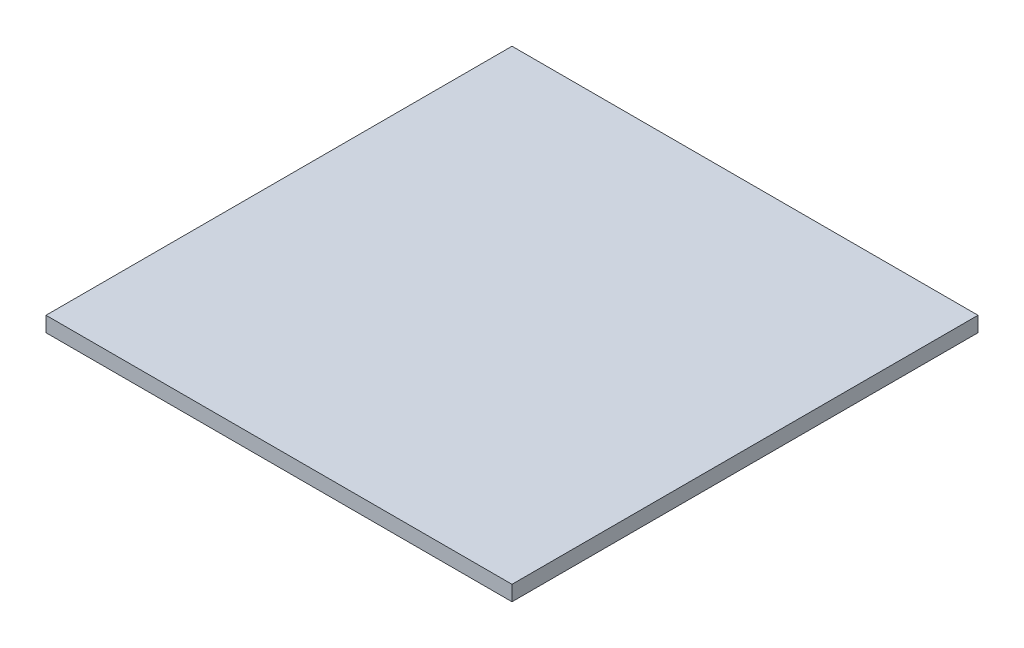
from build123d import *

# Parameters (mm, degrees)
SKETCH_1_W      = 61.5
SKETCH_1_H      = 61.5
EXTRUDE_1_DEPTH = 2


with BuildPart() as part:
    # Sketch 1 → Extrude 1 (new body)
    with BuildSketch(Plane(origin=(0, 0, 0), x_dir=(1, 0, 0), z_dir=(0, 1, 0))):
        with Locations((0.991935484, 5.188585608)):
            Rectangle(SKETCH_1_W, SKETCH_1_H)
    extrude(amount=EXTRUDE_1_DEPTH)


solid = part.part
